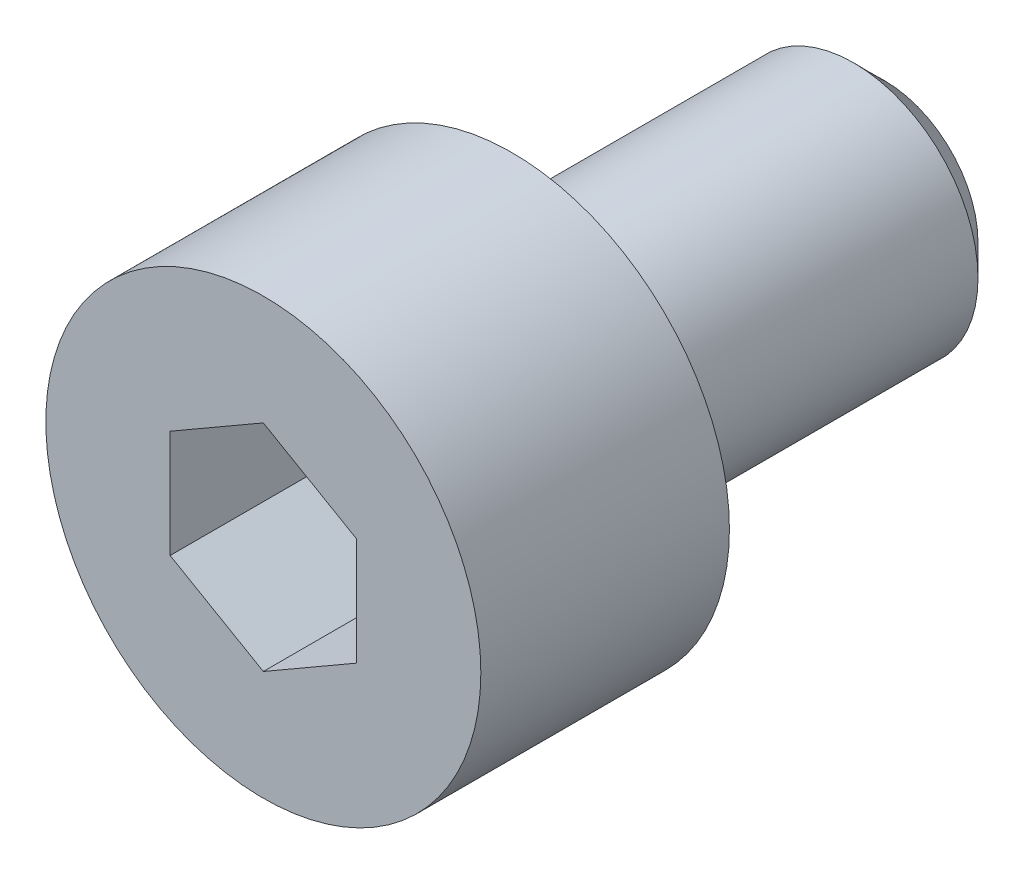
ISO-10303-21;
HEADER;
FILE_DESCRIPTION(('STEP AP214'),'2;1');
FILE_NAME('part.step','',(''),(''),'','','');
FILE_SCHEMA(('AUTOMOTIVE_DESIGN { 1 0 10303 214 1 1 1 1 }'));
ENDSEC;
DATA;
#1=APPLICATION_CONTEXT('core data for automotive mechanical design processes');
#2=APPLICATION_PROTOCOL_DEFINITION('international standard','automotive_design',2000,#1);
#3=PRODUCT_CONTEXT('',#1,'mechanical');
#4=PRODUCT('Part','Part','',(#3));
#5=PRODUCT_RELATED_PRODUCT_CATEGORY('part','',(#4));
#6=PRODUCT_DEFINITION_FORMATION('','',#4);
#7=PRODUCT_DEFINITION_CONTEXT('part definition',#1,'design');
#8=PRODUCT_DEFINITION('design','',#6,#7);
#9=PRODUCT_DEFINITION_SHAPE('','',#8);
#10=(LENGTH_UNIT() NAMED_UNIT(*) SI_UNIT(.MILLI.,.METRE.));
#11=(NAMED_UNIT(*) PLANE_ANGLE_UNIT() SI_UNIT($,.RADIAN.));
#12=(NAMED_UNIT(*) SI_UNIT($,.STERADIAN.) SOLID_ANGLE_UNIT());
#13=UNCERTAINTY_MEASURE_WITH_UNIT(LENGTH_MEASURE(1.E-05),#10,'distance_accuracy_value','');
#14=(GEOMETRIC_REPRESENTATION_CONTEXT(3) GLOBAL_UNCERTAINTY_ASSIGNED_CONTEXT((#13)) GLOBAL_UNIT_ASSIGNED_CONTEXT((#10,
#11,#12)) REPRESENTATION_CONTEXT('',''));
#15=CARTESIAN_POINT('',(0.,0.,0.));
#16=DIRECTION('',(0.,0.,1.));
#17=DIRECTION('',(1.,0.,0.));
#18=AXIS2_PLACEMENT_3D('',#15,#16,#17);
#19=CARTESIAN_POINT('',(0.,0.,-4.));
#20=DIRECTION('',(0.,0.,1.));
#21=DIRECTION('',(1.,0.,0.));
#22=AXIS2_PLACEMENT_3D('',#19,#20,#21);
#23=PLANE('',#22);
#24=CARTESIAN_POINT('',(0.,0.,-4.));
#25=DIRECTION('',(0.,0.,1.));
#26=DIRECTION('',(1.,0.,0.));
#27=AXIS2_PLACEMENT_3D('',#24,#25,#26);
#28=CIRCLE('',#27,3.5);
#29=CARTESIAN_POINT('',(3.5,0.,-4.));
#30=VERTEX_POINT('',#29);
#31=EDGE_CURVE('E142',#30,#30,#28,.T.);
#32=ORIENTED_EDGE('',*,*,#31,.F.);
#33=EDGE_LOOP('',(#32));
#34=FACE_BOUND('',#33,.T.);
#35=CARTESIAN_POINT('',(0.,0.,-4.));
#36=DIRECTION('',(0.,0.,1.));
#37=DIRECTION('',(1.,0.,0.));
#38=AXIS2_PLACEMENT_3D('',#35,#36,#37);
#39=CIRCLE('',#38,2.);
#40=CARTESIAN_POINT('',(2.,0.,-4.));
#41=VERTEX_POINT('',#40);
#42=EDGE_CURVE('E145',#41,#41,#39,.F.);
#43=ORIENTED_EDGE('',*,*,#42,.F.);
#44=EDGE_LOOP('',(#43));
#45=FACE_BOUND('',#44,.T.);
#46=ADVANCED_FACE('F30',(#34,#45),#23,.F.);
#47=CARTESIAN_POINT('',(0.,0.,-4.));
#48=DIRECTION('',(0.,0.,1.));
#49=DIRECTION('',(1.,0.,0.));
#50=AXIS2_PLACEMENT_3D('',#47,#48,#49);
#51=CYLINDRICAL_SURFACE('',#50,3.5);
#52=ORIENTED_EDGE('',*,*,#31,.T.);
#53=EDGE_LOOP('',(#52));
#54=FACE_BOUND('',#53,.T.);
#55=CARTESIAN_POINT('',(0.,0.,0.));
#56=DIRECTION('',(0.,0.,1.));
#57=DIRECTION('',(1.,0.,0.));
#58=AXIS2_PLACEMENT_3D('',#55,#56,#57);
#59=CIRCLE('',#58,3.5);
#60=CARTESIAN_POINT('',(3.5,0.,0.));
#61=VERTEX_POINT('',#60);
#62=EDGE_CURVE('E133',#61,#61,#59,.T.);
#63=ORIENTED_EDGE('',*,*,#62,.F.);
#64=EDGE_LOOP('',(#63));
#65=FACE_BOUND('',#64,.T.);
#66=ADVANCED_FACE('F32',(#54,#65),#51,.T.);
#67=CARTESIAN_POINT('',(0.,0.,0.));
#68=DIRECTION('',(0.,0.,1.));
#69=DIRECTION('',(1.,0.,0.));
#70=AXIS2_PLACEMENT_3D('',#67,#68,#69);
#71=PLANE('',#70);
#72=DIRECTION('',(0.866025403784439,0.5,0.));
#73=VECTOR('',#72,1.);
#74=CARTESIAN_POINT('',(0.,-1.73205080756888,0.));
#75=LINE('',#74,#73);
#76=CARTESIAN_POINT('',(0.,-1.73205080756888,0.));
#77=VERTEX_POINT('',#76);
#78=CARTESIAN_POINT('',(1.5,-0.866025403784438,0.));
#79=VERTEX_POINT('',#78);
#80=EDGE_CURVE('E45',#77,#79,#75,.T.);
#81=ORIENTED_EDGE('',*,*,#80,.F.);
#82=DIRECTION('',(0.866025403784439,-0.5,0.));
#83=VECTOR('',#82,1.);
#84=CARTESIAN_POINT('',(-1.5,-0.866025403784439,0.));
#85=LINE('',#84,#83);
#86=CARTESIAN_POINT('',(-1.5,-0.866025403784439,0.));
#87=VERTEX_POINT('',#86);
#88=EDGE_CURVE('E115',#87,#77,#85,.T.);
#89=ORIENTED_EDGE('',*,*,#88,.F.);
#90=DIRECTION('',(0.,-1.,0.));
#91=VECTOR('',#90,1.);
#92=CARTESIAN_POINT('',(-1.5,0.866025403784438,0.));
#93=LINE('',#92,#91);
#94=CARTESIAN_POINT('',(-1.5,0.866025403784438,0.));
#95=VERTEX_POINT('',#94);
#96=EDGE_CURVE('E109',#95,#87,#93,.T.);
#97=ORIENTED_EDGE('',*,*,#96,.F.);
#98=DIRECTION('',(-0.866025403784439,-0.5,0.));
#99=VECTOR('',#98,1.);
#100=CARTESIAN_POINT('',(0.,1.73205080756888,0.));
#101=LINE('',#100,#99);
#102=CARTESIAN_POINT('',(0.,1.73205080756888,0.));
#103=VERTEX_POINT('',#102);
#104=EDGE_CURVE('E107',#103,#95,#101,.T.);
#105=ORIENTED_EDGE('',*,*,#104,.F.);
#106=DIRECTION('',(-0.866025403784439,0.5,0.));
#107=VECTOR('',#106,1.);
#108=CARTESIAN_POINT('',(1.5,0.866025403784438,0.));
#109=LINE('',#108,#107);
#110=CARTESIAN_POINT('',(1.5,0.866025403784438,0.));
#111=VERTEX_POINT('',#110);
#112=EDGE_CURVE('E88',#111,#103,#109,.T.);
#113=ORIENTED_EDGE('',*,*,#112,.F.);
#114=DIRECTION('',(0.,1.,0.));
#115=VECTOR('',#114,1.);
#116=CARTESIAN_POINT('',(1.5,-0.866025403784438,0.));
#117=LINE('',#116,#115);
#118=EDGE_CURVE('E99',#79,#111,#117,.T.);
#119=ORIENTED_EDGE('',*,*,#118,.F.);
#120=EDGE_LOOP('',(#81,#89,#97,#105,#113,#119));
#121=FACE_BOUND('',#120,.T.);
#122=ORIENTED_EDGE('',*,*,#62,.T.);
#123=EDGE_LOOP('',(#122));
#124=FACE_BOUND('',#123,.T.);
#125=ADVANCED_FACE('F103',(#121,#124),#71,.T.);
#126=CARTESIAN_POINT('',(0.,0.,-10.));
#127=DIRECTION('',(0.,0.,1.));
#128=DIRECTION('',(1.,0.,0.));
#129=AXIS2_PLACEMENT_3D('',#126,#127,#128);
#130=CYLINDRICAL_SURFACE('',#129,2.);
#131=CARTESIAN_POINT('',(0.,0.,-9.5));
#132=DIRECTION('',(0.,0.,-1.));
#133=DIRECTION('',(-1.,0.,0.));
#134=AXIS2_PLACEMENT_3D('',#131,#132,#133);
#135=CIRCLE('',#134,2.);
#136=CARTESIAN_POINT('',(-2.,0.,-9.5));
#137=VERTEX_POINT('',#136);
#138=EDGE_CURVE('E11',#137,#137,#135,.F.);
#139=ORIENTED_EDGE('',*,*,#138,.T.);
#140=EDGE_LOOP('',(#139));
#141=FACE_BOUND('',#140,.T.);
#142=ORIENTED_EDGE('',*,*,#42,.T.);
#143=EDGE_LOOP('',(#142));
#144=FACE_BOUND('',#143,.T.);
#145=ADVANCED_FACE('F174',(#141,#144),#130,.T.);
#146=CARTESIAN_POINT('',(0.,0.,-10.));
#147=DIRECTION('',(0.,0.,-1.));
#148=DIRECTION('',(-1.,0.,0.));
#149=AXIS2_PLACEMENT_3D('',#146,#147,#148);
#150=PLANE('',#149);
#151=CARTESIAN_POINT('',(0.,0.,-10.));
#152=DIRECTION('',(0.,0.,-1.));
#153=DIRECTION('',(-1.,0.,0.));
#154=AXIS2_PLACEMENT_3D('',#151,#152,#153);
#155=CIRCLE('',#154,1.5);
#156=CARTESIAN_POINT('',(-1.5,0.,-10.));
#157=VERTEX_POINT('',#156);
#158=EDGE_CURVE('E38',#157,#157,#155,.T.);
#159=ORIENTED_EDGE('',*,*,#158,.T.);
#160=EDGE_LOOP('',(#159));
#161=FACE_BOUND('',#160,.T.);
#162=ADVANCED_FACE('F150',(#161),#150,.T.);
#163=CARTESIAN_POINT('',(0.,-1.73205080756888,-3.999999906));
#164=DIRECTION('',(0.5,-0.866025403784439,0.));
#165=DIRECTION('',(0.866025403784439,0.5,0.));
#166=AXIS2_PLACEMENT_3D('',#163,#164,#165);
#167=PLANE('',#166);
#168=ORIENTED_EDGE('',*,*,#80,.T.);
#169=DIRECTION('',(0.,0.,1.));
#170=VECTOR('',#169,1.);
#171=CARTESIAN_POINT('',(1.5,-0.866025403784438,-3.999999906));
#172=LINE('',#171,#170);
#173=CARTESIAN_POINT('',(1.5,-0.866025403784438,-3.999999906));
#174=VERTEX_POINT('',#173);
#175=EDGE_CURVE('E96',#174,#79,#172,.T.);
#176=ORIENTED_EDGE('',*,*,#175,.F.);
#177=DIRECTION('',(0.866025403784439,0.5,0.));
#178=VECTOR('',#177,1.);
#179=CARTESIAN_POINT('',(0.,-1.73205080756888,-3.999999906));
#180=LINE('',#179,#178);
#181=CARTESIAN_POINT('',(0.,-1.73205080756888,-3.999999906));
#182=VERTEX_POINT('',#181);
#183=EDGE_CURVE('E117',#182,#174,#180,.T.);
#184=ORIENTED_EDGE('',*,*,#183,.F.);
#185=DIRECTION('',(0.,0.,1.));
#186=VECTOR('',#185,1.);
#187=CARTESIAN_POINT('',(0.,-1.73205080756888,-3.999999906));
#188=LINE('',#187,#186);
#189=EDGE_CURVE('E52',#182,#77,#188,.T.);
#190=ORIENTED_EDGE('',*,*,#189,.T.);
#191=EDGE_LOOP('',(#168,#176,#184,#190));
#192=FACE_BOUND('',#191,.T.);
#193=ADVANCED_FACE('F180',(#192),#167,.F.);
#194=CARTESIAN_POINT('',(-1.5,-0.866025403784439,-3.999999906));
#195=DIRECTION('',(-0.5,-0.866025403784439,0.));
#196=DIRECTION('',(0.866025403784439,-0.5,0.));
#197=AXIS2_PLACEMENT_3D('',#194,#195,#196);
#198=PLANE('',#197);
#199=ORIENTED_EDGE('',*,*,#88,.T.);
#200=ORIENTED_EDGE('',*,*,#189,.F.);
#201=DIRECTION('',(0.866025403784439,-0.5,0.));
#202=VECTOR('',#201,1.);
#203=CARTESIAN_POINT('',(-1.5,-0.866025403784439,-3.999999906));
#204=LINE('',#203,#202);
#205=CARTESIAN_POINT('',(-1.5,-0.866025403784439,-3.999999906));
#206=VERTEX_POINT('',#205);
#207=EDGE_CURVE('E129',#206,#182,#204,.T.);
#208=ORIENTED_EDGE('',*,*,#207,.F.);
#209=DIRECTION('',(0.,0.,1.));
#210=VECTOR('',#209,1.);
#211=CARTESIAN_POINT('',(-1.5,-0.866025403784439,-3.999999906));
#212=LINE('',#211,#210);
#213=EDGE_CURVE('E134',#206,#87,#212,.T.);
#214=ORIENTED_EDGE('',*,*,#213,.T.);
#215=EDGE_LOOP('',(#199,#200,#208,#214));
#216=FACE_BOUND('',#215,.T.);
#217=ADVANCED_FACE('F183',(#216),#198,.F.);
#218=CARTESIAN_POINT('',(-1.5,0.866025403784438,-3.999999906));
#219=DIRECTION('',(-1.,0.,0.));
#220=DIRECTION('',(0.,0.,1.));
#221=AXIS2_PLACEMENT_3D('',#218,#219,#220);
#222=PLANE('',#221);
#223=ORIENTED_EDGE('',*,*,#96,.T.);
#224=ORIENTED_EDGE('',*,*,#213,.F.);
#225=DIRECTION('',(0.,-1.,0.));
#226=VECTOR('',#225,1.);
#227=CARTESIAN_POINT('',(-1.5,0.866025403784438,-3.999999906));
#228=LINE('',#227,#226);
#229=CARTESIAN_POINT('',(-1.5,0.866025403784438,-3.999999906));
#230=VERTEX_POINT('',#229);
#231=EDGE_CURVE('E126',#230,#206,#228,.T.);
#232=ORIENTED_EDGE('',*,*,#231,.F.);
#233=DIRECTION('',(0.,0.,1.));
#234=VECTOR('',#233,1.);
#235=CARTESIAN_POINT('',(-1.5,0.866025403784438,-3.999999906));
#236=LINE('',#235,#234);
#237=EDGE_CURVE('E136',#230,#95,#236,.T.);
#238=ORIENTED_EDGE('',*,*,#237,.T.);
#239=EDGE_LOOP('',(#223,#224,#232,#238));
#240=FACE_BOUND('',#239,.T.);
#241=ADVANCED_FACE('F191',(#240),#222,.F.);
#242=CARTESIAN_POINT('',(0.,1.73205080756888,-3.999999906));
#243=DIRECTION('',(-0.5,0.866025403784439,0.));
#244=DIRECTION('',(-0.866025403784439,-0.5,0.));
#245=AXIS2_PLACEMENT_3D('',#242,#243,#244);
#246=PLANE('',#245);
#247=ORIENTED_EDGE('',*,*,#104,.T.);
#248=ORIENTED_EDGE('',*,*,#237,.F.);
#249=DIRECTION('',(-0.866025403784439,-0.5,0.));
#250=VECTOR('',#249,1.);
#251=CARTESIAN_POINT('',(0.,1.73205080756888,-3.999999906));
#252=LINE('',#251,#250);
#253=CARTESIAN_POINT('',(0.,1.73205080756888,-3.999999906));
#254=VERTEX_POINT('',#253);
#255=EDGE_CURVE('E123',#254,#230,#252,.T.);
#256=ORIENTED_EDGE('',*,*,#255,.F.);
#257=DIRECTION('',(0.,0.,1.));
#258=VECTOR('',#257,1.);
#259=CARTESIAN_POINT('',(0.,1.73205080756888,-3.999999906));
#260=LINE('',#259,#258);
#261=EDGE_CURVE('E95',#254,#103,#260,.T.);
#262=ORIENTED_EDGE('',*,*,#261,.T.);
#263=EDGE_LOOP('',(#247,#248,#256,#262));
#264=FACE_BOUND('',#263,.T.);
#265=ADVANCED_FACE('F188',(#264),#246,.F.);
#266=CARTESIAN_POINT('',(1.5,0.866025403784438,-3.999999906));
#267=DIRECTION('',(0.5,0.866025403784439,0.));
#268=DIRECTION('',(-0.866025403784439,0.5,0.));
#269=AXIS2_PLACEMENT_3D('',#266,#267,#268);
#270=PLANE('',#269);
#271=ORIENTED_EDGE('',*,*,#112,.T.);
#272=ORIENTED_EDGE('',*,*,#261,.F.);
#273=DIRECTION('',(-0.866025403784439,0.5,0.));
#274=VECTOR('',#273,1.);
#275=CARTESIAN_POINT('',(1.5,0.866025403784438,-3.999999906));
#276=LINE('',#275,#274);
#277=CARTESIAN_POINT('',(1.5,0.866025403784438,-3.999999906));
#278=VERTEX_POINT('',#277);
#279=EDGE_CURVE('E91',#278,#254,#276,.T.);
#280=ORIENTED_EDGE('',*,*,#279,.F.);
#281=DIRECTION('',(0.,0.,1.));
#282=VECTOR('',#281,1.);
#283=CARTESIAN_POINT('',(1.5,0.866025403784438,-3.999999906));
#284=LINE('',#283,#282);
#285=EDGE_CURVE('E84',#278,#111,#284,.T.);
#286=ORIENTED_EDGE('',*,*,#285,.T.);
#287=EDGE_LOOP('',(#271,#272,#280,#286));
#288=FACE_BOUND('',#287,.T.);
#289=ADVANCED_FACE('F86',(#288),#270,.F.);
#290=CARTESIAN_POINT('',(1.5,-0.866025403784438,-3.999999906));
#291=DIRECTION('',(1.,0.,0.));
#292=DIRECTION('',(0.,1.,0.));
#293=AXIS2_PLACEMENT_3D('',#290,#291,#292);
#294=PLANE('',#293);
#295=ORIENTED_EDGE('',*,*,#118,.T.);
#296=ORIENTED_EDGE('',*,*,#285,.F.);
#297=DIRECTION('',(0.,1.,0.));
#298=VECTOR('',#297,1.);
#299=CARTESIAN_POINT('',(1.5,-0.866025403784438,-3.999999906));
#300=LINE('',#299,#298);
#301=EDGE_CURVE('E120',#174,#278,#300,.T.);
#302=ORIENTED_EDGE('',*,*,#301,.F.);
#303=ORIENTED_EDGE('',*,*,#175,.T.);
#304=EDGE_LOOP('',(#295,#296,#302,#303));
#305=FACE_BOUND('',#304,.T.);
#306=ADVANCED_FACE('F100',(#305),#294,.F.);
#307=CARTESIAN_POINT('',(3.,0.,-3.999999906));
#308=DIRECTION('',(0.,0.,1.));
#309=DIRECTION('',(1.,0.,0.));
#310=AXIS2_PLACEMENT_3D('',#307,#308,#309);
#311=PLANE('',#310);
#312=ORIENTED_EDGE('',*,*,#183,.T.);
#313=ORIENTED_EDGE('',*,*,#301,.T.);
#314=ORIENTED_EDGE('',*,*,#279,.T.);
#315=ORIENTED_EDGE('',*,*,#255,.T.);
#316=ORIENTED_EDGE('',*,*,#231,.T.);
#317=ORIENTED_EDGE('',*,*,#207,.T.);
#318=EDGE_LOOP('',(#312,#313,#314,#315,#316,#317));
#319=FACE_BOUND('',#318,.T.);
#320=ADVANCED_FACE('F154',(#319),#311,.T.);
#321=CARTESIAN_POINT('',(0.,0.,-10.));
#322=DIRECTION('',(0.,0.,1.));
#323=DIRECTION('',(1.,0.,0.));
#324=AXIS2_PLACEMENT_3D('',#321,#322,#323);
#325=CONICAL_SURFACE('',#324,1.5,0.785398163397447);
#326=ORIENTED_EDGE('',*,*,#138,.F.);
#327=EDGE_LOOP('',(#326));
#328=FACE_BOUND('',#327,.T.);
#329=ORIENTED_EDGE('',*,*,#158,.F.);
#330=EDGE_LOOP('',(#329));
#331=FACE_BOUND('',#330,.T.);
#332=ADVANCED_FACE('F152',(#328,#331),#325,.T.);
#333=CLOSED_SHELL('',(#46,#66,#125,#145,#162,#193,#217,#241,#265,#289,#306,#320,#332));
#334=MANIFOLD_SOLID_BREP('B2',#333);
#335=ADVANCED_BREP_SHAPE_REPRESENTATION('',(#18,#334),#14);
#336=SHAPE_DEFINITION_REPRESENTATION(#9,#335);
ENDSEC;
END-ISO-10303-21;
